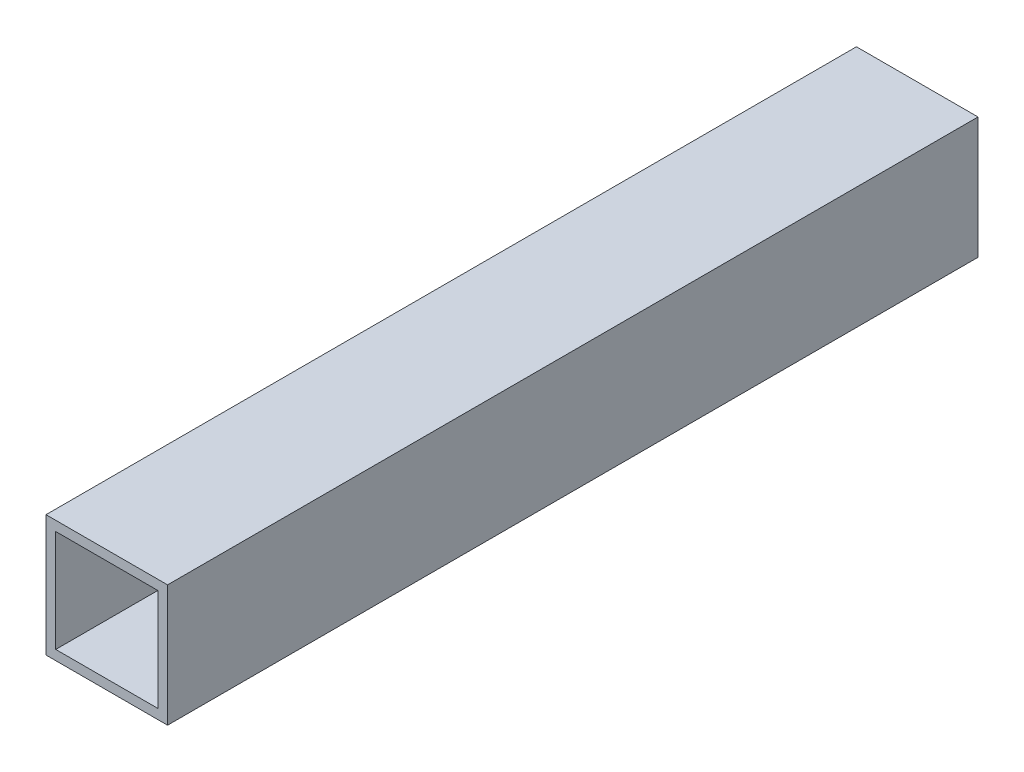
ISO-10303-21;
HEADER;
FILE_DESCRIPTION(('STEP AP214'),'2;1');
FILE_NAME('part.step','',(''),(''),'','','');
FILE_SCHEMA(('AUTOMOTIVE_DESIGN { 1 0 10303 214 1 1 1 1 }'));
ENDSEC;
DATA;
#1=APPLICATION_CONTEXT('core data for automotive mechanical design processes');
#2=APPLICATION_PROTOCOL_DEFINITION('international standard','automotive_design',2000,#1);
#3=PRODUCT_CONTEXT('',#1,'mechanical');
#4=PRODUCT('Part','Part','',(#3));
#5=PRODUCT_RELATED_PRODUCT_CATEGORY('part','',(#4));
#6=PRODUCT_DEFINITION_FORMATION('','',#4);
#7=PRODUCT_DEFINITION_CONTEXT('part definition',#1,'design');
#8=PRODUCT_DEFINITION('design','',#6,#7);
#9=PRODUCT_DEFINITION_SHAPE('','',#8);
#10=(LENGTH_UNIT() NAMED_UNIT(*) SI_UNIT(.MILLI.,.METRE.));
#11=(NAMED_UNIT(*) PLANE_ANGLE_UNIT() SI_UNIT($,.RADIAN.));
#12=(NAMED_UNIT(*) SI_UNIT($,.STERADIAN.) SOLID_ANGLE_UNIT());
#13=UNCERTAINTY_MEASURE_WITH_UNIT(LENGTH_MEASURE(1.E-05),#10,'distance_accuracy_value','');
#14=(GEOMETRIC_REPRESENTATION_CONTEXT(3) GLOBAL_UNCERTAINTY_ASSIGNED_CONTEXT((#13)) GLOBAL_UNIT_ASSIGNED_CONTEXT((#10,
#11,#12)) REPRESENTATION_CONTEXT('',''));
#15=CARTESIAN_POINT('',(0.,0.,0.));
#16=DIRECTION('',(0.,0.,1.));
#17=DIRECTION('',(1.,0.,0.));
#18=AXIS2_PLACEMENT_3D('',#15,#16,#17);
#19=CARTESIAN_POINT('',(0.,0.,1000.));
#20=DIRECTION('',(0.,0.,1.));
#21=DIRECTION('',(1.,0.,0.));
#22=AXIS2_PLACEMENT_3D('',#19,#20,#21);
#23=PLANE('',#22);
#24=DIRECTION('',(0.,-1.,0.));
#25=VECTOR('',#24,1.);
#26=CARTESIAN_POINT('',(-63.,63.,1000.));
#27=LINE('',#26,#25);
#28=CARTESIAN_POINT('',(-63.,63.,1000.));
#29=VERTEX_POINT('',#28);
#30=CARTESIAN_POINT('',(-63.,-63.,1000.));
#31=VERTEX_POINT('',#30);
#32=EDGE_CURVE('E25',#29,#31,#27,.T.);
#33=ORIENTED_EDGE('',*,*,#32,.F.);
#34=DIRECTION('',(-1.,0.,0.));
#35=VECTOR('',#34,1.);
#36=CARTESIAN_POINT('',(63.,63.,1000.));
#37=LINE('',#36,#35);
#38=CARTESIAN_POINT('',(63.,63.,1000.));
#39=VERTEX_POINT('',#38);
#40=EDGE_CURVE('E82',#39,#29,#37,.T.);
#41=ORIENTED_EDGE('',*,*,#40,.F.);
#42=DIRECTION('',(0.,1.,0.));
#43=VECTOR('',#42,1.);
#44=CARTESIAN_POINT('',(63.,-63.,1000.));
#45=LINE('',#44,#43);
#46=CARTESIAN_POINT('',(63.,-63.,1000.));
#47=VERTEX_POINT('',#46);
#48=EDGE_CURVE('E87',#47,#39,#45,.T.);
#49=ORIENTED_EDGE('',*,*,#48,.F.);
#50=DIRECTION('',(1.,0.,0.));
#51=VECTOR('',#50,1.);
#52=CARTESIAN_POINT('',(-63.,-63.,1000.));
#53=LINE('',#52,#51);
#54=EDGE_CURVE('E116',#31,#47,#53,.T.);
#55=ORIENTED_EDGE('',*,*,#54,.F.);
#56=EDGE_LOOP('',(#33,#41,#49,#55));
#57=FACE_BOUND('',#56,.T.);
#58=DIRECTION('',(1.,0.,0.));
#59=VECTOR('',#58,1.);
#60=CARTESIAN_POINT('',(-75.,-75.,1000.));
#61=LINE('',#60,#59);
#62=CARTESIAN_POINT('',(-75.,-75.,1000.));
#63=VERTEX_POINT('',#62);
#64=CARTESIAN_POINT('',(75.,-75.,1000.));
#65=VERTEX_POINT('',#64);
#66=EDGE_CURVE('E180',#63,#65,#61,.T.);
#67=ORIENTED_EDGE('',*,*,#66,.T.);
#68=DIRECTION('',(0.,1.,0.));
#69=VECTOR('',#68,1.);
#70=CARTESIAN_POINT('',(75.,-75.,1000.));
#71=LINE('',#70,#69);
#72=CARTESIAN_POINT('',(75.,75.,1000.));
#73=VERTEX_POINT('',#72);
#74=EDGE_CURVE('E144',#65,#73,#71,.T.);
#75=ORIENTED_EDGE('',*,*,#74,.T.);
#76=DIRECTION('',(-1.,0.,0.));
#77=VECTOR('',#76,1.);
#78=CARTESIAN_POINT('',(75.,75.,1000.));
#79=LINE('',#78,#77);
#80=CARTESIAN_POINT('',(-75.,75.,1000.));
#81=VERTEX_POINT('',#80);
#82=EDGE_CURVE('E157',#73,#81,#79,.T.);
#83=ORIENTED_EDGE('',*,*,#82,.T.);
#84=DIRECTION('',(0.,-1.,0.));
#85=VECTOR('',#84,1.);
#86=CARTESIAN_POINT('',(-75.,75.,1000.));
#87=LINE('',#86,#85);
#88=EDGE_CURVE('E131',#81,#63,#87,.T.);
#89=ORIENTED_EDGE('',*,*,#88,.T.);
#90=EDGE_LOOP('',(#67,#75,#83,#89));
#91=FACE_BOUND('',#90,.T.);
#92=ADVANCED_FACE('F16',(#57,#91),#23,.T.);
#93=CARTESIAN_POINT('',(0.,0.,0.));
#94=DIRECTION('',(0.,0.,1.));
#95=DIRECTION('',(1.,0.,0.));
#96=AXIS2_PLACEMENT_3D('',#93,#94,#95);
#97=PLANE('',#96);
#98=DIRECTION('',(1.,0.,0.));
#99=VECTOR('',#98,1.);
#100=CARTESIAN_POINT('',(-63.,-63.,0.));
#101=LINE('',#100,#99);
#102=CARTESIAN_POINT('',(-63.,-63.,0.));
#103=VERTEX_POINT('',#102);
#104=CARTESIAN_POINT('',(63.,-63.,0.));
#105=VERTEX_POINT('',#104);
#106=EDGE_CURVE('E108',#103,#105,#101,.T.);
#107=ORIENTED_EDGE('',*,*,#106,.T.);
#108=DIRECTION('',(0.,1.,0.));
#109=VECTOR('',#108,1.);
#110=CARTESIAN_POINT('',(63.,-63.,0.));
#111=LINE('',#110,#109);
#112=CARTESIAN_POINT('',(63.,63.,0.));
#113=VERTEX_POINT('',#112);
#114=EDGE_CURVE('E93',#105,#113,#111,.T.);
#115=ORIENTED_EDGE('',*,*,#114,.T.);
#116=DIRECTION('',(-1.,0.,0.));
#117=VECTOR('',#116,1.);
#118=CARTESIAN_POINT('',(63.,63.,0.));
#119=LINE('',#118,#117);
#120=CARTESIAN_POINT('',(-63.,63.,0.));
#121=VERTEX_POINT('',#120);
#122=EDGE_CURVE('E98',#113,#121,#119,.T.);
#123=ORIENTED_EDGE('',*,*,#122,.T.);
#124=DIRECTION('',(0.,-1.,0.));
#125=VECTOR('',#124,1.);
#126=CARTESIAN_POINT('',(-63.,63.,0.));
#127=LINE('',#126,#125);
#128=EDGE_CURVE('E10',#121,#103,#127,.T.);
#129=ORIENTED_EDGE('',*,*,#128,.T.);
#130=EDGE_LOOP('',(#107,#115,#123,#129));
#131=FACE_BOUND('',#130,.T.);
#132=DIRECTION('',(0.,-1.,0.));
#133=VECTOR('',#132,1.);
#134=CARTESIAN_POINT('',(-75.,75.,0.));
#135=LINE('',#134,#133);
#136=CARTESIAN_POINT('',(-75.,75.,0.));
#137=VERTEX_POINT('',#136);
#138=CARTESIAN_POINT('',(-75.,-75.,0.));
#139=VERTEX_POINT('',#138);
#140=EDGE_CURVE('E137',#137,#139,#135,.T.);
#141=ORIENTED_EDGE('',*,*,#140,.F.);
#142=DIRECTION('',(-1.,0.,0.));
#143=VECTOR('',#142,1.);
#144=CARTESIAN_POINT('',(75.,75.,0.));
#145=LINE('',#144,#143);
#146=CARTESIAN_POINT('',(75.,75.,0.));
#147=VERTEX_POINT('',#146);
#148=EDGE_CURVE('E149',#147,#137,#145,.T.);
#149=ORIENTED_EDGE('',*,*,#148,.F.);
#150=DIRECTION('',(0.,1.,0.));
#151=VECTOR('',#150,1.);
#152=CARTESIAN_POINT('',(75.,-75.,0.));
#153=LINE('',#152,#151);
#154=CARTESIAN_POINT('',(75.,-75.,0.));
#155=VERTEX_POINT('',#154);
#156=EDGE_CURVE('E145',#155,#147,#153,.T.);
#157=ORIENTED_EDGE('',*,*,#156,.F.);
#158=DIRECTION('',(1.,0.,0.));
#159=VECTOR('',#158,1.);
#160=CARTESIAN_POINT('',(-75.,-75.,0.));
#161=LINE('',#160,#159);
#162=EDGE_CURVE('E173',#139,#155,#161,.T.);
#163=ORIENTED_EDGE('',*,*,#162,.F.);
#164=EDGE_LOOP('',(#141,#149,#157,#163));
#165=FACE_BOUND('',#164,.T.);
#166=ADVANCED_FACE('F166',(#131,#165),#97,.F.);
#167=CARTESIAN_POINT('',(-63.,63.,0.));
#168=DIRECTION('',(1.,0.,0.));
#169=DIRECTION('',(0.,1.,0.));
#170=AXIS2_PLACEMENT_3D('',#167,#168,#169);
#171=PLANE('',#170);
#172=DIRECTION('',(0.,0.,1.));
#173=VECTOR('',#172,1.);
#174=CARTESIAN_POINT('',(-63.,63.,0.));
#175=LINE('',#174,#173);
#176=EDGE_CURVE('E92',#121,#29,#175,.T.);
#177=ORIENTED_EDGE('',*,*,#176,.T.);
#178=ORIENTED_EDGE('',*,*,#32,.T.);
#179=DIRECTION('',(0.,0.,1.));
#180=VECTOR('',#179,1.);
#181=CARTESIAN_POINT('',(-63.,-63.,0.));
#182=LINE('',#181,#180);
#183=EDGE_CURVE('E126',#103,#31,#182,.T.);
#184=ORIENTED_EDGE('',*,*,#183,.F.);
#185=ORIENTED_EDGE('',*,*,#128,.F.);
#186=EDGE_LOOP('',(#177,#178,#184,#185));
#187=FACE_BOUND('',#186,.T.);
#188=ADVANCED_FACE('F124',(#187),#171,.T.);
#189=CARTESIAN_POINT('',(63.,63.,0.));
#190=DIRECTION('',(0.,-1.,0.));
#191=DIRECTION('',(0.,0.,-1.));
#192=AXIS2_PLACEMENT_3D('',#189,#190,#191);
#193=PLANE('',#192);
#194=DIRECTION('',(0.,0.,1.));
#195=VECTOR('',#194,1.);
#196=CARTESIAN_POINT('',(63.,63.,0.));
#197=LINE('',#196,#195);
#198=EDGE_CURVE('E96',#113,#39,#197,.T.);
#199=ORIENTED_EDGE('',*,*,#198,.T.);
#200=ORIENTED_EDGE('',*,*,#40,.T.);
#201=ORIENTED_EDGE('',*,*,#176,.F.);
#202=ORIENTED_EDGE('',*,*,#122,.F.);
#203=EDGE_LOOP('',(#199,#200,#201,#202));
#204=FACE_BOUND('',#203,.T.);
#205=ADVANCED_FACE('F97',(#204),#193,.T.);
#206=CARTESIAN_POINT('',(63.,-63.,0.));
#207=DIRECTION('',(-1.,0.,0.));
#208=DIRECTION('',(0.,0.,1.));
#209=AXIS2_PLACEMENT_3D('',#206,#207,#208);
#210=PLANE('',#209);
#211=DIRECTION('',(0.,0.,1.));
#212=VECTOR('',#211,1.);
#213=CARTESIAN_POINT('',(63.,-63.,0.));
#214=LINE('',#213,#212);
#215=EDGE_CURVE('E105',#105,#47,#214,.T.);
#216=ORIENTED_EDGE('',*,*,#215,.T.);
#217=ORIENTED_EDGE('',*,*,#48,.T.);
#218=ORIENTED_EDGE('',*,*,#198,.F.);
#219=ORIENTED_EDGE('',*,*,#114,.F.);
#220=EDGE_LOOP('',(#216,#217,#218,#219));
#221=FACE_BOUND('',#220,.T.);
#222=ADVANCED_FACE('F103',(#221),#210,.T.);
#223=CARTESIAN_POINT('',(-63.,-63.,0.));
#224=DIRECTION('',(0.,1.,0.));
#225=DIRECTION('',(1.,0.,0.));
#226=AXIS2_PLACEMENT_3D('',#223,#224,#225);
#227=PLANE('',#226);
#228=ORIENTED_EDGE('',*,*,#183,.T.);
#229=ORIENTED_EDGE('',*,*,#54,.T.);
#230=ORIENTED_EDGE('',*,*,#215,.F.);
#231=ORIENTED_EDGE('',*,*,#106,.F.);
#232=EDGE_LOOP('',(#228,#229,#230,#231));
#233=FACE_BOUND('',#232,.T.);
#234=ADVANCED_FACE('F129',(#233),#227,.T.);
#235=CARTESIAN_POINT('',(-75.,75.,0.));
#236=DIRECTION('',(1.,0.,0.));
#237=DIRECTION('',(0.,1.,0.));
#238=AXIS2_PLACEMENT_3D('',#235,#236,#237);
#239=PLANE('',#238);
#240=ORIENTED_EDGE('',*,*,#140,.T.);
#241=DIRECTION('',(0.,0.,1.));
#242=VECTOR('',#241,1.);
#243=CARTESIAN_POINT('',(-75.,-75.,0.));
#244=LINE('',#243,#242);
#245=EDGE_CURVE('E184',#139,#63,#244,.T.);
#246=ORIENTED_EDGE('',*,*,#245,.T.);
#247=ORIENTED_EDGE('',*,*,#88,.F.);
#248=DIRECTION('',(0.,0.,1.));
#249=VECTOR('',#248,1.);
#250=CARTESIAN_POINT('',(-75.,75.,0.));
#251=LINE('',#250,#249);
#252=EDGE_CURVE('E153',#137,#81,#251,.T.);
#253=ORIENTED_EDGE('',*,*,#252,.F.);
#254=EDGE_LOOP('',(#240,#246,#247,#253));
#255=FACE_BOUND('',#254,.T.);
#256=ADVANCED_FACE('F211',(#255),#239,.F.);
#257=CARTESIAN_POINT('',(75.,75.,0.));
#258=DIRECTION('',(0.,-1.,0.));
#259=DIRECTION('',(0.,0.,-1.));
#260=AXIS2_PLACEMENT_3D('',#257,#258,#259);
#261=PLANE('',#260);
#262=ORIENTED_EDGE('',*,*,#148,.T.);
#263=ORIENTED_EDGE('',*,*,#252,.T.);
#264=ORIENTED_EDGE('',*,*,#82,.F.);
#265=DIRECTION('',(0.,0.,1.));
#266=VECTOR('',#265,1.);
#267=CARTESIAN_POINT('',(75.,75.,0.));
#268=LINE('',#267,#266);
#269=EDGE_CURVE('E141',#147,#73,#268,.T.);
#270=ORIENTED_EDGE('',*,*,#269,.F.);
#271=EDGE_LOOP('',(#262,#263,#264,#270));
#272=FACE_BOUND('',#271,.T.);
#273=ADVANCED_FACE('F216',(#272),#261,.F.);
#274=CARTESIAN_POINT('',(75.,-75.,0.));
#275=DIRECTION('',(-1.,0.,0.));
#276=DIRECTION('',(0.,0.,1.));
#277=AXIS2_PLACEMENT_3D('',#274,#275,#276);
#278=PLANE('',#277);
#279=ORIENTED_EDGE('',*,*,#156,.T.);
#280=ORIENTED_EDGE('',*,*,#269,.T.);
#281=ORIENTED_EDGE('',*,*,#74,.F.);
#282=DIRECTION('',(0.,0.,1.));
#283=VECTOR('',#282,1.);
#284=CARTESIAN_POINT('',(75.,-75.,0.));
#285=LINE('',#284,#283);
#286=EDGE_CURVE('E176',#155,#65,#285,.T.);
#287=ORIENTED_EDGE('',*,*,#286,.F.);
#288=EDGE_LOOP('',(#279,#280,#281,#287));
#289=FACE_BOUND('',#288,.T.);
#290=ADVANCED_FACE('F193',(#289),#278,.F.);
#291=CARTESIAN_POINT('',(-75.,-75.,0.));
#292=DIRECTION('',(0.,1.,0.));
#293=DIRECTION('',(1.,0.,0.));
#294=AXIS2_PLACEMENT_3D('',#291,#292,#293);
#295=PLANE('',#294);
#296=ORIENTED_EDGE('',*,*,#162,.T.);
#297=ORIENTED_EDGE('',*,*,#286,.T.);
#298=ORIENTED_EDGE('',*,*,#66,.F.);
#299=ORIENTED_EDGE('',*,*,#245,.F.);
#300=EDGE_LOOP('',(#296,#297,#298,#299));
#301=FACE_BOUND('',#300,.T.);
#302=ADVANCED_FACE('F214',(#301),#295,.F.);
#303=CLOSED_SHELL('',(#92,#166,#188,#205,#222,#234,#256,#273,#290,#302));
#304=MANIFOLD_SOLID_BREP('B1',#303);
#305=ADVANCED_BREP_SHAPE_REPRESENTATION('',(#18,#304),#14);
#306=SHAPE_DEFINITION_REPRESENTATION(#9,#305);
ENDSEC;
END-ISO-10303-21;
